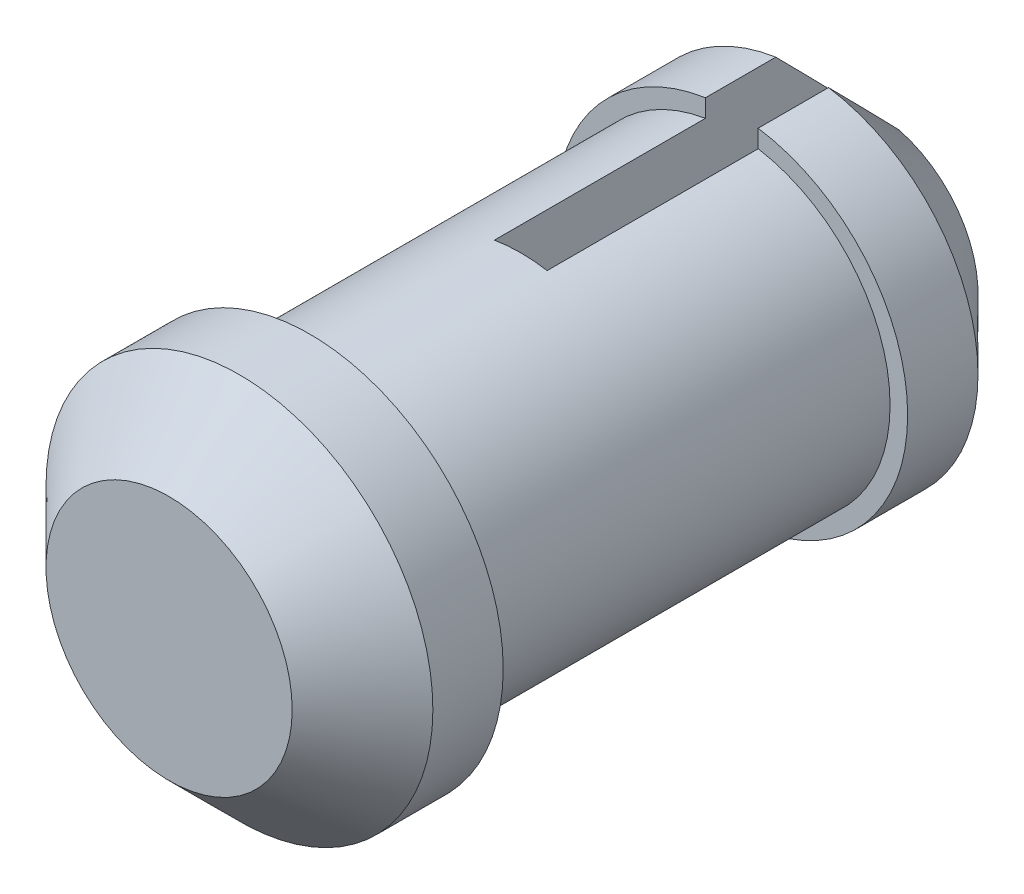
from build123d import *

# Parameters (mm, degrees)
CROQUIS1_R              = 4.5
SALIENTE_EXTRUIR1_DEPTH = 12
CROQUIS2_R              = 5
SALIENTE_EXTRUIR2_DEPTH = 4
CROQUIS3_R              = 5.5
SALIENTE_EXTRUIR3_DEPTH = 4
CROQUIS4_W              = 1.5
CROQUIS4_H              = 10.575793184
CORTAR_EXTRUIR1_DEPTH   = 10
CHAFL_N1_SIZE           = 2


with BuildPart() as part:
    # Croquis1 → Saliente-Extruir1 (new body)
    with BuildSketch(Plane.XY):
        Circle(CROQUIS1_R)
    extrude(amount=SALIENTE_EXTRUIR1_DEPTH)

    # Croquis2 → Saliente-Extruir2 (add)
    with BuildSketch(Plane(origin=(0, 0, 0), x_dir=(-1, 0, 0), z_dir=(0, 0, -1))):
        Circle(CROQUIS2_R)
    extrude(amount=SALIENTE_EXTRUIR2_DEPTH)

    # Croquis3 → Saliente-Extruir3 (add)
    with BuildSketch(Plane.XY.offset(12)):
        Circle(CROQUIS3_R)
    extrude(amount=SALIENTE_EXTRUIR3_DEPTH)

    # Croquis4 → Cortar-Extruir1 (cut)
    with BuildSketch(Plane(origin=(0, 0, -4), x_dir=(-1, 0, 0), z_dir=(0, 0, -1))):
        with Locations((0, 0.015667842)):
            Rectangle(CROQUIS4_W, CROQUIS4_H)
    extrude(amount=-CORTAR_EXTRUIR1_DEPTH, mode=Mode.SUBTRACT)

    # Chafl_n1
    chafl_n1_edges = [part.edges().sort_by_distance(p)[0] for p in [
        (-5.5, 0, 16),
        (5, 0, -4),
        (-5, 0, -4),
    ]]
    chamfer(chafl_n1_edges, length=CHAFL_N1_SIZE)


solid = part.part
